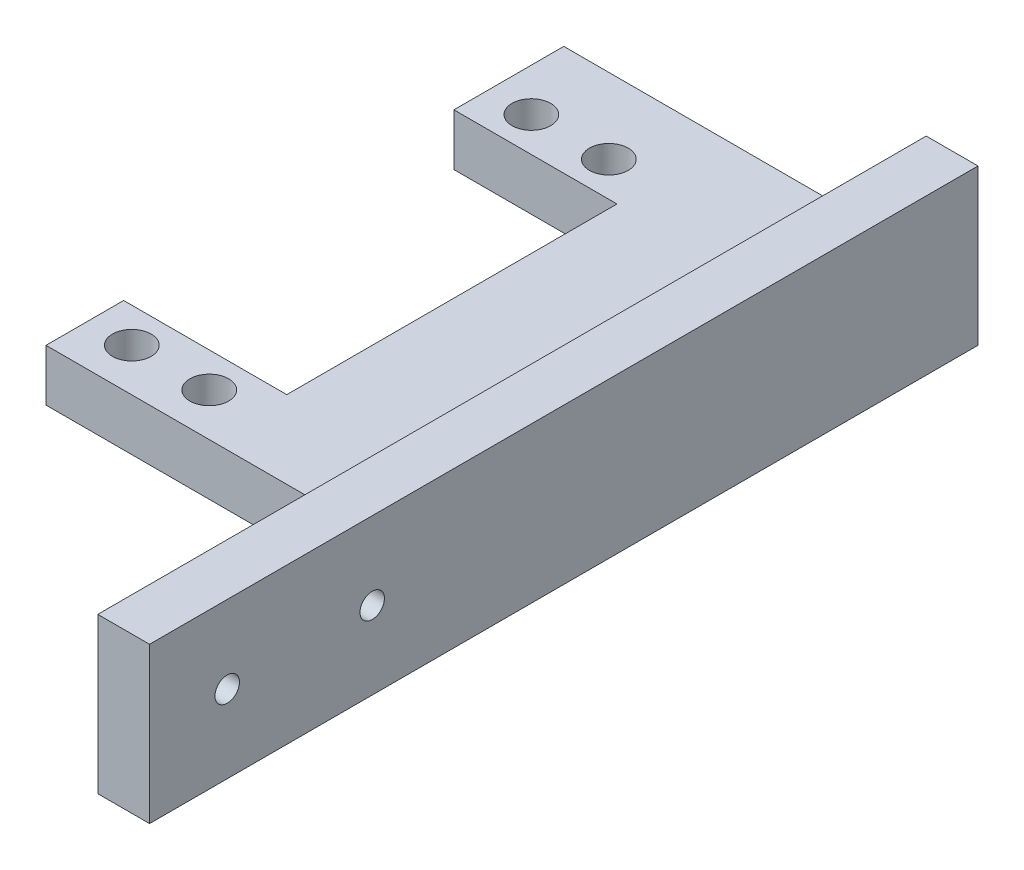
from build123d import *

# Parameters (mm, degrees)
SKETCH1_W           = 101.6
SKETCH1_H           = 19.05
SKETCH1_R           = 1.5
BOSS_EXTRUDE1_DEPTH = 6.35
SKETCH2_W           = 63.5
SKETCH2_H           = 6.35
BOSS_EXTRUDE2_DEPTH = 50.8
SKETCH3_R           = 2.374999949
SKETCH3_W           = 20
SKETCH3_H           = 40.500000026
CUT_EXTRUDE1_DEPTH  = 104.028627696


with BuildPart() as part:
    # Sketch1 → Boss-Extrude1 (new body)
    with BuildSketch(Plane(origin=(0, 0, 0), x_dir=(0, 0, -1), z_dir=(1, 0, 0))):
        with Locations((41.275, 0)):
            Rectangle(SKETCH1_W, SKETCH1_H)
        Circle(SKETCH1_R, mode=Mode.SUBTRACT)
        with Locations((17.78, 0)):
            Circle(SKETCH1_R, mode=Mode.SUBTRACT)
    extrude(amount=BOSS_EXTRUDE1_DEPTH)

    # Sketch2 → Boss-Extrude2 (add)
    with BuildSketch(Plane(origin=(6.35, 0, 0), x_dir=(0, 0, -1), z_dir=(1, 0, 0))):
        with Locations((60.325, -6.35)):
            Rectangle(SKETCH2_W, SKETCH2_H)
    extrude(amount=-BOSS_EXTRUDE2_DEPTH)

    # Sketch3 → Cut-Extrude1 (cut, through all)
    with BuildSketch(Plane(origin=(0, -3.175, 0), x_dir=(1, 0, 0), z_dir=(0, 1, 0))):
        with Locations(Location((-39.199999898, 33.849999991, 0), (0, 0, 270))):
            Circle(SKETCH3_R)
        with Locations(Location((-29.700000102, 33.849999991, 0), (0, 0, 90))):
            Circle(SKETCH3_R)
        with Locations(Location((-29.700000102, 82.850000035, 0), (0, 0, 270))):
            Circle(SKETCH3_R)
        with Locations(Location((-39.199999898, 82.850000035, 0), (0, 0, 90))):
            Circle(SKETCH3_R)
        with Locations((-34.45, 58.350000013)):
            Rectangle(SKETCH3_W, SKETCH3_H)
    extrude(amount=-CUT_EXTRUDE1_DEPTH, mode=Mode.SUBTRACT)


solid = part.part
